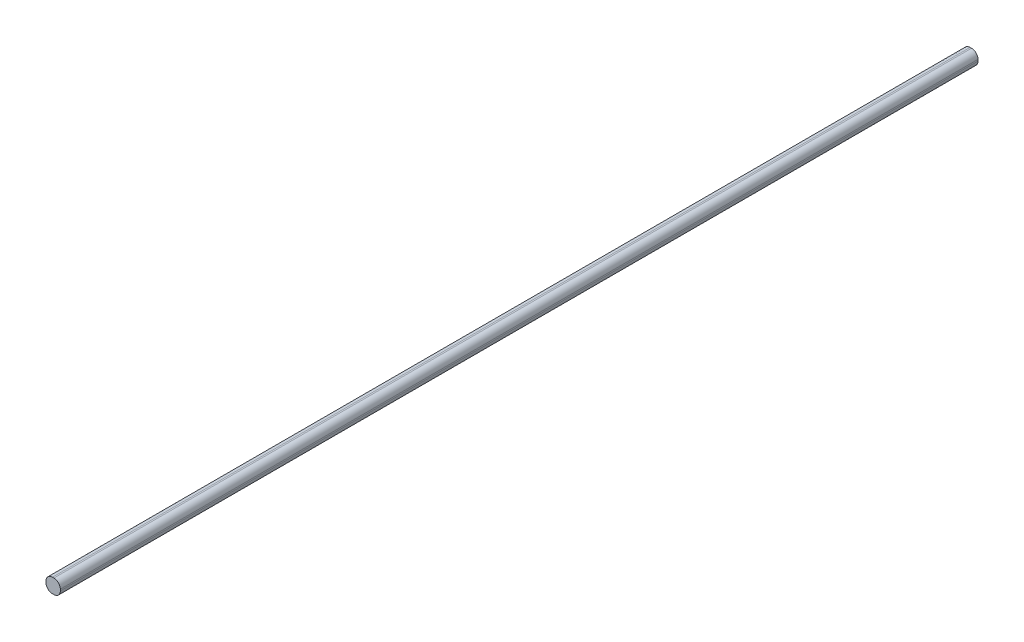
from build123d import *

# Parameters (mm, degrees)
BASE_EXTRUDE_DEPTH      = 254
BASE_EXTRUDE_DEPTH_BACK = 254
SKETCH1_W               = 7.9375
SKETCH1_H               = 7.9375
FILLET1_R               = 3.556


with BuildPart() as part:
    # Sketch1 → Base-Extrude (new, two sides: drawn at the far end of the back side and taken through both)
    with BuildSketch(Plane.XY.offset(-BASE_EXTRUDE_DEPTH_BACK)):
        Rectangle(SKETCH1_W, SKETCH1_H)
    extrude(amount=BASE_EXTRUDE_DEPTH + BASE_EXTRUDE_DEPTH_BACK)

    # Fillet1
    fillet1_edges = [part.edges().sort_by_distance(p)[0] for p in [
        (-3.96875, -3.96875, 0),
        (3.96875, -3.96875, 0),
        (3.96875, 3.96875, 0),
        (-3.96875, 3.96875, 0),
    ]]
    fillet(fillet1_edges, radius=FILLET1_R)


solid = part.part
